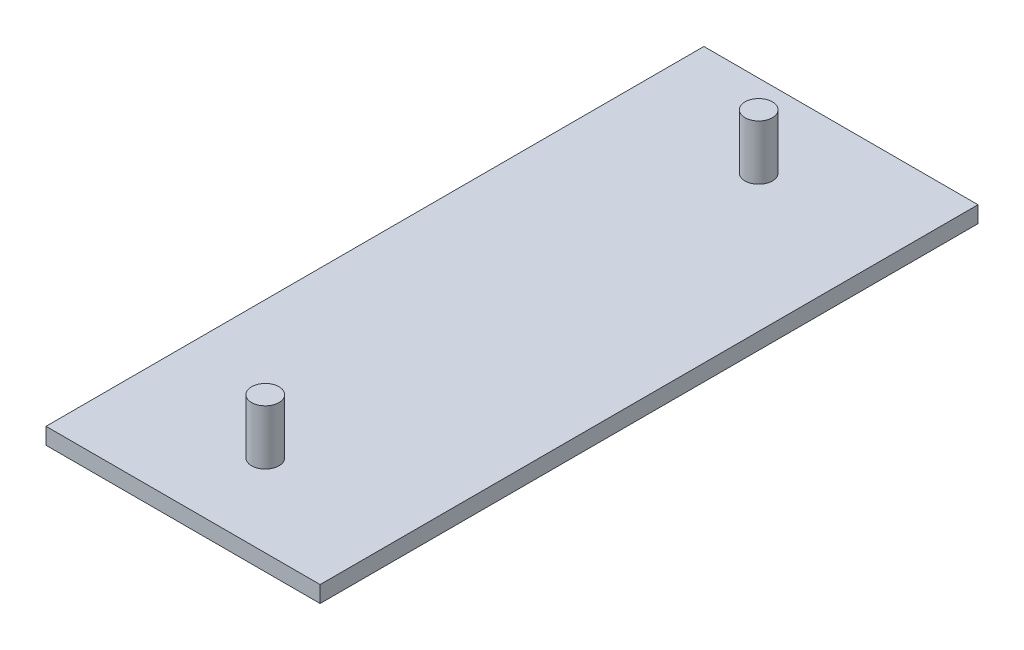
from build123d import *

# Parameters (mm, degrees)
ESQUISSE1_W      = 50
ESQUISSE1_H      = 120
EXTRUSION1_DEPTH = 3
ESQUISSE2_R      = 2.5
EXTRUSION2_DEPTH = 10


with BuildPart() as part:
    # Esquisse1 → Extrusion1 (new body)
    with BuildSketch(Plane(origin=(0, 0, 0), x_dir=(1, 0, 0), z_dir=(0, 1, 0))):
        Rectangle(ESQUISSE1_W, ESQUISSE1_H)
    extrude(amount=EXTRUSION1_DEPTH)

    # Esquisse2 → Extrusion2 (add)
    with BuildSketch(Plane(origin=(0, 3, 0), x_dir=(1, 0, 0), z_dir=(0, 1, 0))):
        with Locations(Location((0, 45, 0), (0, 0, 270))):
            Circle(ESQUISSE2_R)
        with Locations(Location((0, -45, 0), (0, 0, 270))):
            Circle(ESQUISSE2_R)
    extrude(amount=EXTRUSION2_DEPTH)


solid = part.part
